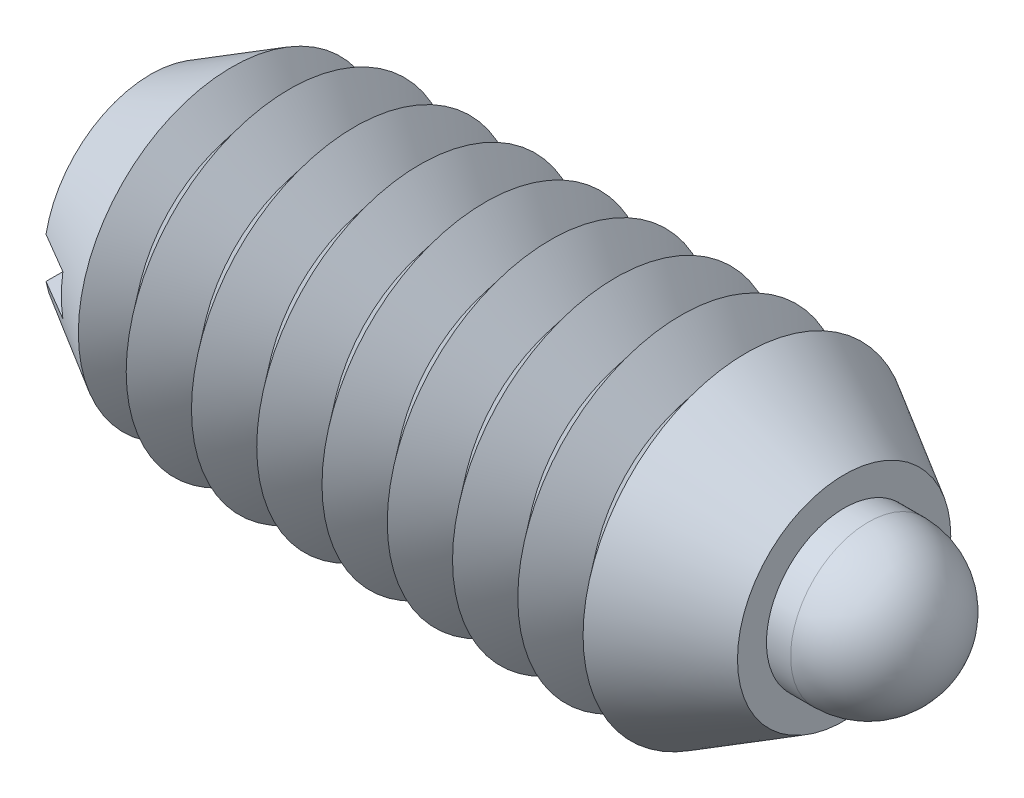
ISO-10303-21;
HEADER;
FILE_DESCRIPTION(('STEP AP214'),'2;1');
FILE_NAME('part.step','',(''),(''),'','','');
FILE_SCHEMA(('AUTOMOTIVE_DESIGN { 1 0 10303 214 1 1 1 1 }'));
ENDSEC;
DATA;
#1=APPLICATION_CONTEXT('core data for automotive mechanical design processes');
#2=APPLICATION_PROTOCOL_DEFINITION('international standard','automotive_design',2000,#1);
#3=PRODUCT_CONTEXT('',#1,'mechanical');
#4=PRODUCT('Part','Part','',(#3));
#5=PRODUCT_RELATED_PRODUCT_CATEGORY('part','',(#4));
#6=PRODUCT_DEFINITION_FORMATION('','',#4);
#7=PRODUCT_DEFINITION_CONTEXT('part definition',#1,'design');
#8=PRODUCT_DEFINITION('design','',#6,#7);
#9=PRODUCT_DEFINITION_SHAPE('','',#8);
#10=(LENGTH_UNIT() NAMED_UNIT(*) SI_UNIT(.MILLI.,.METRE.));
#11=(NAMED_UNIT(*) PLANE_ANGLE_UNIT() SI_UNIT($,.RADIAN.));
#12=(NAMED_UNIT(*) SI_UNIT($,.STERADIAN.) SOLID_ANGLE_UNIT());
#13=UNCERTAINTY_MEASURE_WITH_UNIT(LENGTH_MEASURE(1.E-05),#10,'distance_accuracy_value','');
#14=(GEOMETRIC_REPRESENTATION_CONTEXT(3) GLOBAL_UNCERTAINTY_ASSIGNED_CONTEXT((#13)) GLOBAL_UNIT_ASSIGNED_CONTEXT((#10,
#11,#12)) REPRESENTATION_CONTEXT('',''));
#15=CARTESIAN_POINT('',(0.,0.,0.));
#16=DIRECTION('',(0.,0.,1.));
#17=DIRECTION('',(1.,0.,0.));
#18=AXIS2_PLACEMENT_3D('',#15,#16,#17);
#19=CARTESIAN_POINT('',(10.01776,0.,0.));
#20=DIRECTION('',(-1.,0.,0.));
#21=DIRECTION('',(0.,-0.719424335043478,-0.694570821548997));
#22=AXIS2_PLACEMENT_3D('',#19,#20,#21);
#23=PLANE('',#22);
#24=CARTESIAN_POINT('',(10.01776,0.,0.));
#25=DIRECTION('',(1.,0.,0.));
#26=DIRECTION('',(0.,0.719424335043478,0.694570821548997));
#27=AXIS2_PLACEMENT_3D('',#24,#25,#26);
#28=CIRCLE('',#27,1.5113);
#29=CARTESIAN_POINT('',(10.01776,1.08726599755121,1.049704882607));
#30=VERTEX_POINT('',#29);
#31=EDGE_CURVE('P0_E10',#30,#30,#28,.T.);
#32=ORIENTED_EDGE('',*,*,#31,.F.);
#33=EDGE_LOOP('',(#32));
#34=FACE_BOUND('',#33,.T.);
#35=ADVANCED_FACE('P0_F14',(#34),#23,.T.);
#36=CARTESIAN_POINT('',(10.32002,0.,0.));
#37=DIRECTION('',(1.,0.,0.));
#38=DIRECTION('',(0.,0.719424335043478,0.694570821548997));
#39=AXIS2_PLACEMENT_3D('',#36,#37,#38);
#40=CONICAL_SURFACE('',#39,1.81356,0.78539816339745);
#41=ORIENTED_EDGE('',*,*,#31,.T.);
#42=EDGE_LOOP('',(#41));
#43=FACE_BOUND('',#42,.T.);
#44=CARTESIAN_POINT('',(10.32002,0.,0.));
#45=DIRECTION('',(1.,0.,0.));
#46=DIRECTION('',(0.,0.719424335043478,0.694570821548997));
#47=AXIS2_PLACEMENT_3D('',#44,#45,#46);
#48=CIRCLE('',#47,1.81356);
#49=CARTESIAN_POINT('',(10.32002,1.30471919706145,1.2596458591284));
#50=VERTEX_POINT('',#49);
#51=EDGE_CURVE('P0_E20',#50,#50,#48,.T.);
#52=ORIENTED_EDGE('',*,*,#51,.F.);
#53=EDGE_LOOP('',(#52));
#54=FACE_BOUND('',#53,.T.);
#55=ADVANCED_FACE('P0_F54',(#43,#54),#40,.T.);
#56=CARTESIAN_POINT('',(15.47495,0.,0.));
#57=DIRECTION('',(1.,0.,0.));
#58=DIRECTION('',(0.,0.719424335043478,0.694570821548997));
#59=AXIS2_PLACEMENT_3D('',#56,#57,#58);
#60=CYLINDRICAL_SURFACE('',#59,1.81356);
#61=ORIENTED_EDGE('',*,*,#51,.T.);
#62=EDGE_LOOP('',(#61));
#63=FACE_BOUND('',#62,.T.);
#64=CARTESIAN_POINT('',(12.5168303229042,0.,0.));
#65=DIRECTION('',(1.,0.,0.));
#66=DIRECTION('',(0.,0.719424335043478,0.694570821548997));
#67=AXIS2_PLACEMENT_3D('',#64,#65,#66);
#68=CIRCLE('',#67,1.81356);
#69=CARTESIAN_POINT('',(12.5168303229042,1.30471919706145,1.2596458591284));
#70=VERTEX_POINT('',#69);
#71=EDGE_CURVE('P0_E24',#70,#70,#68,.T.);
#72=ORIENTED_EDGE('',*,*,#71,.F.);
#73=EDGE_LOOP('',(#72));
#74=FACE_BOUND('',#73,.T.);
#75=ADVANCED_FACE('P0_F50',(#63,#74),#60,.T.);
#76=CARTESIAN_POINT('',(13.04036,0.,0.));
#77=DIRECTION('',(-1.,0.,0.));
#78=DIRECTION('',(0.,-0.719424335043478,-0.694570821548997));
#79=AXIS2_PLACEMENT_3D('',#76,#77,#78);
#80=CONICAL_SURFACE('',#79,1.5113,0.5235987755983);
#81=ORIENTED_EDGE('',*,*,#71,.T.);
#82=EDGE_LOOP('',(#81));
#83=FACE_BOUND('',#82,.T.);
#84=CARTESIAN_POINT('',(13.04036,0.,0.));
#85=DIRECTION('',(1.,0.,0.));
#86=DIRECTION('',(0.,0.719424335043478,0.694570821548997));
#87=AXIS2_PLACEMENT_3D('',#84,#85,#86);
#88=CIRCLE('',#87,1.5113);
#89=CARTESIAN_POINT('',(13.04036,1.08726599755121,1.049704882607));
#90=VERTEX_POINT('',#89);
#91=EDGE_CURVE('P0_E28',#90,#90,#88,.T.);
#92=ORIENTED_EDGE('',*,*,#91,.F.);
#93=EDGE_LOOP('',(#92));
#94=FACE_BOUND('',#93,.T.);
#95=ADVANCED_FACE('P0_F41',(#83,#94),#80,.T.);
#96=CARTESIAN_POINT('',(15.47495,0.,0.));
#97=DIRECTION('',(1.,0.,0.));
#98=DIRECTION('',(0.,0.719424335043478,0.694570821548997));
#99=AXIS2_PLACEMENT_3D('',#96,#97,#98);
#100=CYLINDRICAL_SURFACE('',#99,1.5113);
#101=ORIENTED_EDGE('',*,*,#91,.T.);
#102=EDGE_LOOP('',(#101));
#103=FACE_BOUND('',#102,.T.);
#104=CARTESIAN_POINT('',(13.96365,0.,0.));
#105=DIRECTION('',(1.,0.,0.));
#106=DIRECTION('',(0.,0.719424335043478,0.694570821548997));
#107=AXIS2_PLACEMENT_3D('',#104,#105,#106);
#108=CIRCLE('',#107,1.5113);
#109=CARTESIAN_POINT('',(13.96365,1.08726599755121,1.049704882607));
#110=VERTEX_POINT('',#109);
#111=EDGE_CURVE('P0_E33',#110,#110,#108,.T.);
#112=ORIENTED_EDGE('',*,*,#111,.F.);
#113=EDGE_LOOP('',(#112));
#114=FACE_BOUND('',#113,.T.);
#115=ADVANCED_FACE('P0_F39',(#103,#114),#100,.T.);
#116=CARTESIAN_POINT('',(13.96365,0.,0.));
#117=DIRECTION('',(1.,0.,0.));
#118=DIRECTION('',(0.,0.719424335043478,0.694570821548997));
#119=AXIS2_PLACEMENT_3D('',#116,#117,#118);
#120=SPHERICAL_SURFACE('',#119,1.5113);
#121=ORIENTED_EDGE('',*,*,#111,.T.);
#122=EDGE_LOOP('',(#121));
#123=FACE_BOUND('',#122,.T.);
#124=ADVANCED_FACE('P0_F37',(#123),#120,.T.);
#125=CLOSED_SHELL('',(#35,#55,#75,#95,#115,#124));
#126=MANIFOLD_SOLID_BREP('P0_B1',#125);
#127=CARTESIAN_POINT('',(13.49375,0.,0.));
#128=DIRECTION('',(1.,0.,0.));
#129=DIRECTION('',(0.,0.,-1.));
#130=AXIS2_PLACEMENT_3D('',#127,#128,#129);
#131=PLANE('',#130);
#132=CARTESIAN_POINT('',(13.49375,0.,0.));
#133=DIRECTION('',(1.,0.,0.));
#134=DIRECTION('',(0.,0.,-1.));
#135=AXIS2_PLACEMENT_3D('',#132,#133,#134);
#136=CIRCLE('',#135,2.07514773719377);
#137=CARTESIAN_POINT('',(13.49375,0.,-2.07514773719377));
#138=VERTEX_POINT('',#137);
#139=EDGE_CURVE('P1_E78',#138,#138,#136,.T.);
#140=ORIENTED_EDGE('',*,*,#139,.T.);
#141=EDGE_LOOP('',(#140));
#142=FACE_BOUND('',#141,.T.);
#143=CARTESIAN_POINT('',(13.49375,0.,0.));
#144=DIRECTION('',(-1.,0.,0.));
#145=DIRECTION('',(0.,0.,1.));
#146=AXIS2_PLACEMENT_3D('',#143,#144,#145);
#147=CIRCLE('',#146,1.5113);
#148=CARTESIAN_POINT('',(13.49375,0.,1.5113));
#149=VERTEX_POINT('',#148);
#150=EDGE_CURVE('P1_E65',#149,#149,#147,.T.);
#151=ORIENTED_EDGE('',*,*,#150,.T.);
#152=EDGE_LOOP('',(#151));
#153=FACE_BOUND('',#152,.T.);
#154=ADVANCED_FACE('P1_F15',(#142,#153),#131,.T.);
#155=CARTESIAN_POINT('',(13.49375,0.,0.));
#156=DIRECTION('',(-1.,0.,0.));
#157=DIRECTION('',(0.,0.,1.));
#158=AXIS2_PLACEMENT_3D('',#155,#156,#157);
#159=CONICAL_SURFACE('',#158,2.07514773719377,0.523598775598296);
#160=CARTESIAN_POINT('',(11.58875,0.,0.));
#161=DIRECTION('',(-1.,0.,0.));
#162=DIRECTION('',(0.,0.,1.));
#163=AXIS2_PLACEMENT_3D('',#160,#161,#162);
#164=CIRCLE('',#163,3.175);
#165=CARTESIAN_POINT('',(11.58875,0.,3.175));
#166=VERTEX_POINT('',#165);
#167=EDGE_CURVE('P1_E127',#166,#166,#164,.T.);
#168=ORIENTED_EDGE('',*,*,#167,.F.);
#169=EDGE_LOOP('',(#168));
#170=FACE_BOUND('',#169,.T.);
#171=ORIENTED_EDGE('',*,*,#139,.F.);
#172=EDGE_LOOP('',(#171));
#173=FACE_BOUND('',#172,.T.);
#174=ADVANCED_FACE('P1_F17',(#170,#173),#159,.T.);
#175=CARTESIAN_POINT('',(0.,0.,0.));
#176=DIRECTION('',(-1.,0.,0.));
#177=DIRECTION('',(0.,0.,1.));
#178=AXIS2_PLACEMENT_3D('',#175,#176,#177);
#179=CYLINDRICAL_SURFACE('',#178,1.5113);
#180=CARTESIAN_POINT('',(13.04036,0.,0.));
#181=DIRECTION('',(-1.,0.,0.));
#182=DIRECTION('',(0.,0.,1.));
#183=AXIS2_PLACEMENT_3D('',#180,#181,#182);
#184=CIRCLE('',#183,1.5113);
#185=CARTESIAN_POINT('',(13.04036,0.,1.5113));
#186=VERTEX_POINT('',#185);
#187=EDGE_CURVE('P1_E115',#186,#186,#184,.T.);
#188=ORIENTED_EDGE('',*,*,#187,.T.);
#189=EDGE_LOOP('',(#188));
#190=FACE_BOUND('',#189,.T.);
#191=ORIENTED_EDGE('',*,*,#150,.F.);
#192=EDGE_LOOP('',(#191));
#193=FACE_BOUND('',#192,.T.);
#194=ADVANCED_FACE('P1_F196',(#190,#193),#179,.F.);
#195=CARTESIAN_POINT('',(13.04036,0.,0.));
#196=DIRECTION('',(-1.,0.,0.));
#197=DIRECTION('',(0.,0.,1.));
#198=AXIS2_PLACEMENT_3D('',#195,#196,#197);
#199=CONICAL_SURFACE('',#198,1.5113,0.785398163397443);
#200=CARTESIAN_POINT('',(12.7381,0.,0.));
#201=DIRECTION('',(-1.,0.,0.));
#202=DIRECTION('',(0.,0.,1.));
#203=AXIS2_PLACEMENT_3D('',#200,#201,#202);
#204=CIRCLE('',#203,1.81356);
#205=CARTESIAN_POINT('',(12.7381,0.,1.81356));
#206=VERTEX_POINT('',#205);
#207=EDGE_CURVE('P1_E118',#206,#206,#204,.T.);
#208=ORIENTED_EDGE('',*,*,#207,.T.);
#209=EDGE_LOOP('',(#208));
#210=FACE_BOUND('',#209,.T.);
#211=ORIENTED_EDGE('',*,*,#187,.F.);
#212=EDGE_LOOP('',(#211));
#213=FACE_BOUND('',#212,.T.);
#214=ADVANCED_FACE('P1_F203',(#210,#213),#199,.F.);
#215=CARTESIAN_POINT('',(0.,0.,0.));
#216=DIRECTION('',(-1.,0.,0.));
#217=DIRECTION('',(0.,0.,1.));
#218=AXIS2_PLACEMENT_3D('',#215,#216,#217);
#219=CYLINDRICAL_SURFACE('',#218,1.81356);
#220=CARTESIAN_POINT('',(2.38125,0.,0.));
#221=DIRECTION('',(-1.,0.,0.));
#222=DIRECTION('',(0.,0.,1.));
#223=AXIS2_PLACEMENT_3D('',#220,#221,#222);
#224=CIRCLE('',#223,1.81356);
#225=CARTESIAN_POINT('',(2.38125,0.,1.81356));
#226=VERTEX_POINT('',#225);
#227=EDGE_CURVE('P1_E121',#226,#226,#224,.T.);
#228=ORIENTED_EDGE('',*,*,#227,.T.);
#229=EDGE_LOOP('',(#228));
#230=FACE_BOUND('',#229,.T.);
#231=ORIENTED_EDGE('',*,*,#207,.F.);
#232=EDGE_LOOP('',(#231));
#233=FACE_BOUND('',#232,.T.);
#234=ADVANCED_FACE('P1_F208',(#230,#233),#219,.F.);
#235=CARTESIAN_POINT('',(2.38125,0.,0.));
#236=DIRECTION('',(1.,0.,0.));
#237=DIRECTION('',(0.,0.,-1.));
#238=AXIS2_PLACEMENT_3D('',#235,#236,#237);
#239=PLANE('',#238);
#240=ORIENTED_EDGE('',*,*,#227,.F.);
#241=EDGE_LOOP('',(#240));
#242=FACE_BOUND('',#241,.T.);
#243=ADVANCED_FACE('P1_F214',(#242),#239,.T.);
#244=CARTESIAN_POINT('',(10.95375,0.,0.));
#245=DIRECTION('',(1.,0.,0.));
#246=DIRECTION('',(0.,0.,-1.));
#247=AXIS2_PLACEMENT_3D('',#244,#245,#246);
#248=CONICAL_SURFACE('',#247,2.3818852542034,0.895664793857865);
#249=ORIENTED_EDGE('',*,*,#167,.T.);
#250=EDGE_LOOP('',(#249));
#251=FACE_BOUND('',#250,.T.);
#252=CARTESIAN_POINT('',(10.95375,0.,0.));
#253=DIRECTION('',(-1.,0.,0.));
#254=DIRECTION('',(0.,0.,1.));
#255=AXIS2_PLACEMENT_3D('',#252,#253,#254);
#256=CIRCLE('',#255,2.3818852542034);
#257=CARTESIAN_POINT('',(10.95375,0.,2.3818852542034));
#258=VERTEX_POINT('',#257);
#259=EDGE_CURVE('P1_E124',#258,#258,#256,.T.);
#260=ORIENTED_EDGE('',*,*,#259,.F.);
#261=EDGE_LOOP('',(#260));
#262=FACE_BOUND('',#261,.T.);
#263=ADVANCED_FACE('P1_F218',(#251,#262),#248,.T.);
#264=CARTESIAN_POINT('',(10.31875,0.,0.));
#265=DIRECTION('',(-1.,0.,0.));
#266=DIRECTION('',(0.,0.,1.));
#267=AXIS2_PLACEMENT_3D('',#264,#265,#266);
#268=CONICAL_SURFACE('',#267,3.175,0.895664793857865);
#269=ORIENTED_EDGE('',*,*,#259,.T.);
#270=EDGE_LOOP('',(#269));
#271=FACE_BOUND('',#270,.T.);
#272=CARTESIAN_POINT('',(10.31875,0.,0.));
#273=DIRECTION('',(-1.,0.,0.));
#274=DIRECTION('',(0.,0.,1.));
#275=AXIS2_PLACEMENT_3D('',#272,#273,#274);
#276=CIRCLE('',#275,3.175);
#277=CARTESIAN_POINT('',(10.31875,0.,3.175));
#278=VERTEX_POINT('',#277);
#279=EDGE_CURVE('P1_E133',#278,#278,#276,.T.);
#280=ORIENTED_EDGE('',*,*,#279,.F.);
#281=EDGE_LOOP('',(#280));
#282=FACE_BOUND('',#281,.T.);
#283=ADVANCED_FACE('P1_F222',(#271,#282),#268,.T.);
#284=CARTESIAN_POINT('',(9.68374999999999,0.,0.));
#285=DIRECTION('',(1.,0.,0.));
#286=DIRECTION('',(0.,0.,-1.));
#287=AXIS2_PLACEMENT_3D('',#284,#285,#286);
#288=CONICAL_SURFACE('',#287,2.3818852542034,0.895664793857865);
#289=ORIENTED_EDGE('',*,*,#279,.T.);
#290=EDGE_LOOP('',(#289));
#291=FACE_BOUND('',#290,.T.);
#292=CARTESIAN_POINT('',(9.68374999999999,0.,0.));
#293=DIRECTION('',(-1.,0.,0.));
#294=DIRECTION('',(0.,0.,1.));
#295=AXIS2_PLACEMENT_3D('',#292,#293,#294);
#296=CIRCLE('',#295,2.3818852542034);
#297=CARTESIAN_POINT('',(9.68374999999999,0.,2.3818852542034));
#298=VERTEX_POINT('',#297);
#299=EDGE_CURVE('P1_E130',#298,#298,#296,.T.);
#300=ORIENTED_EDGE('',*,*,#299,.F.);
#301=EDGE_LOOP('',(#300));
#302=FACE_BOUND('',#301,.T.);
#303=ADVANCED_FACE('P1_F226',(#291,#302),#288,.T.);
#304=CARTESIAN_POINT('',(9.04874999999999,0.,0.));
#305=DIRECTION('',(-1.,0.,0.));
#306=DIRECTION('',(0.,0.,1.));
#307=AXIS2_PLACEMENT_3D('',#304,#305,#306);
#308=CONICAL_SURFACE('',#307,3.175,0.895664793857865);
#309=ORIENTED_EDGE('',*,*,#299,.T.);
#310=EDGE_LOOP('',(#309));
#311=FACE_BOUND('',#310,.T.);
#312=CARTESIAN_POINT('',(9.04874999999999,0.,0.));
#313=DIRECTION('',(-1.,0.,0.));
#314=DIRECTION('',(0.,0.,1.));
#315=AXIS2_PLACEMENT_3D('',#312,#313,#314);
#316=CIRCLE('',#315,3.175);
#317=CARTESIAN_POINT('',(9.04874999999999,0.,3.175));
#318=VERTEX_POINT('',#317);
#319=EDGE_CURVE('P1_E139',#318,#318,#316,.T.);
#320=ORIENTED_EDGE('',*,*,#319,.F.);
#321=EDGE_LOOP('',(#320));
#322=FACE_BOUND('',#321,.T.);
#323=ADVANCED_FACE('P1_F230',(#311,#322),#308,.T.);
#324=CARTESIAN_POINT('',(8.41374999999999,0.,0.));
#325=DIRECTION('',(1.,0.,0.));
#326=DIRECTION('',(0.,0.,-1.));
#327=AXIS2_PLACEMENT_3D('',#324,#325,#326);
#328=CONICAL_SURFACE('',#327,2.3818852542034,0.895664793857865);
#329=ORIENTED_EDGE('',*,*,#319,.T.);
#330=EDGE_LOOP('',(#329));
#331=FACE_BOUND('',#330,.T.);
#332=CARTESIAN_POINT('',(8.41374999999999,0.,0.));
#333=DIRECTION('',(-1.,0.,0.));
#334=DIRECTION('',(0.,0.,1.));
#335=AXIS2_PLACEMENT_3D('',#332,#333,#334);
#336=CIRCLE('',#335,2.3818852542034);
#337=CARTESIAN_POINT('',(8.41374999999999,0.,2.3818852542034));
#338=VERTEX_POINT('',#337);
#339=EDGE_CURVE('P1_E136',#338,#338,#336,.T.);
#340=ORIENTED_EDGE('',*,*,#339,.F.);
#341=EDGE_LOOP('',(#340));
#342=FACE_BOUND('',#341,.T.);
#343=ADVANCED_FACE('P1_F234',(#331,#342),#328,.T.);
#344=CARTESIAN_POINT('',(7.77874999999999,0.,0.));
#345=DIRECTION('',(-1.,0.,0.));
#346=DIRECTION('',(0.,0.,1.));
#347=AXIS2_PLACEMENT_3D('',#344,#345,#346);
#348=CONICAL_SURFACE('',#347,3.175,0.895664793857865);
#349=ORIENTED_EDGE('',*,*,#339,.T.);
#350=EDGE_LOOP('',(#349));
#351=FACE_BOUND('',#350,.T.);
#352=CARTESIAN_POINT('',(7.77874999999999,0.,0.));
#353=DIRECTION('',(-1.,0.,0.));
#354=DIRECTION('',(0.,0.,1.));
#355=AXIS2_PLACEMENT_3D('',#352,#353,#354);
#356=CIRCLE('',#355,3.175);
#357=CARTESIAN_POINT('',(7.77874999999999,0.,3.175));
#358=VERTEX_POINT('',#357);
#359=EDGE_CURVE('P1_E145',#358,#358,#356,.T.);
#360=ORIENTED_EDGE('',*,*,#359,.F.);
#361=EDGE_LOOP('',(#360));
#362=FACE_BOUND('',#361,.T.);
#363=ADVANCED_FACE('P1_F238',(#351,#362),#348,.T.);
#364=CARTESIAN_POINT('',(7.14374999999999,0.,0.));
#365=DIRECTION('',(1.,0.,0.));
#366=DIRECTION('',(0.,0.,-1.));
#367=AXIS2_PLACEMENT_3D('',#364,#365,#366);
#368=CONICAL_SURFACE('',#367,2.3818852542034,0.895664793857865);
#369=ORIENTED_EDGE('',*,*,#359,.T.);
#370=EDGE_LOOP('',(#369));
#371=FACE_BOUND('',#370,.T.);
#372=CARTESIAN_POINT('',(7.14374999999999,0.,0.));
#373=DIRECTION('',(-1.,0.,0.));
#374=DIRECTION('',(0.,0.,1.));
#375=AXIS2_PLACEMENT_3D('',#372,#373,#374);
#376=CIRCLE('',#375,2.3818852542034);
#377=CARTESIAN_POINT('',(7.14374999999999,0.,2.3818852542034));
#378=VERTEX_POINT('',#377);
#379=EDGE_CURVE('P1_E142',#378,#378,#376,.T.);
#380=ORIENTED_EDGE('',*,*,#379,.F.);
#381=EDGE_LOOP('',(#380));
#382=FACE_BOUND('',#381,.T.);
#383=ADVANCED_FACE('P1_F242',(#371,#382),#368,.T.);
#384=CARTESIAN_POINT('',(6.50874999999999,0.,0.));
#385=DIRECTION('',(-1.,0.,0.));
#386=DIRECTION('',(0.,0.,1.));
#387=AXIS2_PLACEMENT_3D('',#384,#385,#386);
#388=CONICAL_SURFACE('',#387,3.175,0.895664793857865);
#389=ORIENTED_EDGE('',*,*,#379,.T.);
#390=EDGE_LOOP('',(#389));
#391=FACE_BOUND('',#390,.T.);
#392=CARTESIAN_POINT('',(6.50874999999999,0.,0.));
#393=DIRECTION('',(-1.,0.,0.));
#394=DIRECTION('',(0.,0.,1.));
#395=AXIS2_PLACEMENT_3D('',#392,#393,#394);
#396=CIRCLE('',#395,3.175);
#397=CARTESIAN_POINT('',(6.50874999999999,0.,3.175));
#398=VERTEX_POINT('',#397);
#399=EDGE_CURVE('P1_E151',#398,#398,#396,.T.);
#400=ORIENTED_EDGE('',*,*,#399,.F.);
#401=EDGE_LOOP('',(#400));
#402=FACE_BOUND('',#401,.T.);
#403=ADVANCED_FACE('P1_F246',(#391,#402),#388,.T.);
#404=CARTESIAN_POINT('',(5.87374999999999,0.,0.));
#405=DIRECTION('',(1.,0.,0.));
#406=DIRECTION('',(0.,0.,-1.));
#407=AXIS2_PLACEMENT_3D('',#404,#405,#406);
#408=CONICAL_SURFACE('',#407,2.3818852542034,0.895664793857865);
#409=ORIENTED_EDGE('',*,*,#399,.T.);
#410=EDGE_LOOP('',(#409));
#411=FACE_BOUND('',#410,.T.);
#412=CARTESIAN_POINT('',(5.87374999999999,0.,0.));
#413=DIRECTION('',(-1.,0.,0.));
#414=DIRECTION('',(0.,0.,1.));
#415=AXIS2_PLACEMENT_3D('',#412,#413,#414);
#416=CIRCLE('',#415,2.3818852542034);
#417=CARTESIAN_POINT('',(5.87374999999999,0.,2.3818852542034));
#418=VERTEX_POINT('',#417);
#419=EDGE_CURVE('P1_E148',#418,#418,#416,.T.);
#420=ORIENTED_EDGE('',*,*,#419,.F.);
#421=EDGE_LOOP('',(#420));
#422=FACE_BOUND('',#421,.T.);
#423=ADVANCED_FACE('P1_F250',(#411,#422),#408,.T.);
#424=CARTESIAN_POINT('',(5.23874999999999,0.,0.));
#425=DIRECTION('',(-1.,0.,0.));
#426=DIRECTION('',(0.,0.,1.));
#427=AXIS2_PLACEMENT_3D('',#424,#425,#426);
#428=CONICAL_SURFACE('',#427,3.175,0.895664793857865);
#429=ORIENTED_EDGE('',*,*,#419,.T.);
#430=EDGE_LOOP('',(#429));
#431=FACE_BOUND('',#430,.T.);
#432=CARTESIAN_POINT('',(5.23874999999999,0.,0.));
#433=DIRECTION('',(-1.,0.,0.));
#434=DIRECTION('',(0.,0.,1.));
#435=AXIS2_PLACEMENT_3D('',#432,#433,#434);
#436=CIRCLE('',#435,3.175);
#437=CARTESIAN_POINT('',(5.23874999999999,0.,3.175));
#438=VERTEX_POINT('',#437);
#439=EDGE_CURVE('P1_E157',#438,#438,#436,.T.);
#440=ORIENTED_EDGE('',*,*,#439,.F.);
#441=EDGE_LOOP('',(#440));
#442=FACE_BOUND('',#441,.T.);
#443=ADVANCED_FACE('P1_F254',(#431,#442),#428,.T.);
#444=CARTESIAN_POINT('',(4.60374999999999,0.,0.));
#445=DIRECTION('',(1.,0.,0.));
#446=DIRECTION('',(0.,0.,-1.));
#447=AXIS2_PLACEMENT_3D('',#444,#445,#446);
#448=CONICAL_SURFACE('',#447,2.3818852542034,0.895664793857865);
#449=ORIENTED_EDGE('',*,*,#439,.T.);
#450=EDGE_LOOP('',(#449));
#451=FACE_BOUND('',#450,.T.);
#452=CARTESIAN_POINT('',(4.60374999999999,0.,0.));
#453=DIRECTION('',(-1.,0.,0.));
#454=DIRECTION('',(0.,0.,1.));
#455=AXIS2_PLACEMENT_3D('',#452,#453,#454);
#456=CIRCLE('',#455,2.3818852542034);
#457=CARTESIAN_POINT('',(4.60374999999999,0.,2.3818852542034));
#458=VERTEX_POINT('',#457);
#459=EDGE_CURVE('P1_E154',#458,#458,#456,.T.);
#460=ORIENTED_EDGE('',*,*,#459,.F.);
#461=EDGE_LOOP('',(#460));
#462=FACE_BOUND('',#461,.T.);
#463=ADVANCED_FACE('P1_F258',(#451,#462),#448,.T.);
#464=CARTESIAN_POINT('',(3.96874999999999,0.,0.));
#465=DIRECTION('',(-1.,0.,0.));
#466=DIRECTION('',(0.,0.,1.));
#467=AXIS2_PLACEMENT_3D('',#464,#465,#466);
#468=CONICAL_SURFACE('',#467,3.175,0.895664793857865);
#469=ORIENTED_EDGE('',*,*,#459,.T.);
#470=EDGE_LOOP('',(#469));
#471=FACE_BOUND('',#470,.T.);
#472=CARTESIAN_POINT('',(3.96874999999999,0.,0.));
#473=DIRECTION('',(-1.,0.,0.));
#474=DIRECTION('',(0.,0.,1.));
#475=AXIS2_PLACEMENT_3D('',#472,#473,#474);
#476=CIRCLE('',#475,3.175);
#477=CARTESIAN_POINT('',(3.96874999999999,0.,3.175));
#478=VERTEX_POINT('',#477);
#479=EDGE_CURVE('P1_E163',#478,#478,#476,.T.);
#480=ORIENTED_EDGE('',*,*,#479,.F.);
#481=EDGE_LOOP('',(#480));
#482=FACE_BOUND('',#481,.T.);
#483=ADVANCED_FACE('P1_F188',(#471,#482),#468,.T.);
#484=CARTESIAN_POINT('',(3.33374999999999,0.,0.));
#485=DIRECTION('',(1.,0.,0.));
#486=DIRECTION('',(0.,0.,-1.));
#487=AXIS2_PLACEMENT_3D('',#484,#485,#486);
#488=CONICAL_SURFACE('',#487,2.3818852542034,0.895664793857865);
#489=ORIENTED_EDGE('',*,*,#479,.T.);
#490=EDGE_LOOP('',(#489));
#491=FACE_BOUND('',#490,.T.);
#492=CARTESIAN_POINT('',(3.33374999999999,0.,0.));
#493=DIRECTION('',(-1.,0.,0.));
#494=DIRECTION('',(0.,0.,1.));
#495=AXIS2_PLACEMENT_3D('',#492,#493,#494);
#496=CIRCLE('',#495,2.3818852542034);
#497=CARTESIAN_POINT('',(3.33374999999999,0.,2.3818852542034));
#498=VERTEX_POINT('',#497);
#499=EDGE_CURVE('P1_E160',#498,#498,#496,.T.);
#500=ORIENTED_EDGE('',*,*,#499,.F.);
#501=EDGE_LOOP('',(#500));
#502=FACE_BOUND('',#501,.T.);
#503=ADVANCED_FACE('P1_F178',(#491,#502),#488,.T.);
#504=CARTESIAN_POINT('',(2.69874999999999,0.,0.));
#505=DIRECTION('',(-1.,0.,0.));
#506=DIRECTION('',(0.,0.,1.));
#507=AXIS2_PLACEMENT_3D('',#504,#505,#506);
#508=CONICAL_SURFACE('',#507,3.175,0.895664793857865);
#509=ORIENTED_EDGE('',*,*,#499,.T.);
#510=EDGE_LOOP('',(#509));
#511=FACE_BOUND('',#510,.T.);
#512=CARTESIAN_POINT('',(2.69874999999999,0.,0.));
#513=DIRECTION('',(-1.,0.,0.));
#514=DIRECTION('',(0.,0.,1.));
#515=AXIS2_PLACEMENT_3D('',#512,#513,#514);
#516=CIRCLE('',#515,3.175);
#517=CARTESIAN_POINT('',(2.69874999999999,0.,3.175));
#518=VERTEX_POINT('',#517);
#519=EDGE_CURVE('P1_E169',#518,#518,#516,.T.);
#520=ORIENTED_EDGE('',*,*,#519,.F.);
#521=EDGE_LOOP('',(#520));
#522=FACE_BOUND('',#521,.T.);
#523=ADVANCED_FACE('P1_F176',(#511,#522),#508,.T.);
#524=CARTESIAN_POINT('',(2.06374999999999,0.,0.));
#525=DIRECTION('',(1.,0.,0.));
#526=DIRECTION('',(0.,0.,-1.));
#527=AXIS2_PLACEMENT_3D('',#524,#525,#526);
#528=CONICAL_SURFACE('',#527,2.3818852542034,0.895664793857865);
#529=ORIENTED_EDGE('',*,*,#519,.T.);
#530=EDGE_LOOP('',(#529));
#531=FACE_BOUND('',#530,.T.);
#532=CARTESIAN_POINT('',(2.06374999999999,0.,0.));
#533=DIRECTION('',(-1.,0.,0.));
#534=DIRECTION('',(0.,0.,1.));
#535=AXIS2_PLACEMENT_3D('',#532,#533,#534);
#536=CIRCLE('',#535,2.3818852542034);
#537=CARTESIAN_POINT('',(2.06374999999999,0.,2.3818852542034));
#538=VERTEX_POINT('',#537);
#539=EDGE_CURVE('P1_E166',#538,#538,#536,.T.);
#540=ORIENTED_EDGE('',*,*,#539,.F.);
#541=EDGE_LOOP('',(#540));
#542=FACE_BOUND('',#541,.T.);
#543=ADVANCED_FACE('P1_F173',(#531,#542),#528,.T.);
#544=CARTESIAN_POINT('',(1.42874999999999,0.,0.));
#545=DIRECTION('',(-1.,0.,0.));
#546=DIRECTION('',(0.,0.,1.));
#547=AXIS2_PLACEMENT_3D('',#544,#545,#546);
#548=CONICAL_SURFACE('',#547,3.175,0.895664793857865);
#549=CARTESIAN_POINT('',(1.57930333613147,0.,0.));
#550=DIRECTION('',(-1.,0.,0.));
#551=DIRECTION('',(0.,0.,1.));
#552=AXIS2_PLACEMENT_3D('',#549,#550,#551);
#553=CIRCLE('',#552,2.98695894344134);
#554=CARTESIAN_POINT('',(1.57930333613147,0.,2.98695894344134));
#555=VERTEX_POINT('',#554);
#556=EDGE_CURVE('P1_E19',#555,#555,#553,.T.);
#557=ORIENTED_EDGE('',*,*,#556,.F.);
#558=EDGE_LOOP('',(#557));
#559=FACE_BOUND('',#558,.T.);
#560=ORIENTED_EDGE('',*,*,#539,.T.);
#561=EDGE_LOOP('',(#560));
#562=FACE_BOUND('',#561,.T.);
#563=ADVANCED_FACE('P1_F186',(#559,#562),#548,.T.);
#564=CARTESIAN_POINT('',(0.,0.,0.));
#565=DIRECTION('',(1.,0.,0.));
#566=DIRECTION('',(0.,0.,-1.));
#567=AXIS2_PLACEMENT_3D('',#564,#565,#566);
#568=PLANE('',#567);
#569=CARTESIAN_POINT('',(0.,0.,0.));
#570=DIRECTION('',(1.,0.,0.));
#571=DIRECTION('',(0.,0.,-1.));
#572=AXIS2_PLACEMENT_3D('',#569,#570,#571);
#573=CIRCLE('',#572,2.07514773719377);
#574=CARTESIAN_POINT('',(0.,-0.396875,-2.03684274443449));
#575=VERTEX_POINT('',#574);
#576=CARTESIAN_POINT('',(0.,-0.396875,2.03684274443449));
#577=VERTEX_POINT('',#576);
#578=EDGE_CURVE('P1_E74',#575,#577,#573,.F.);
#579=ORIENTED_EDGE('',*,*,#578,.T.);
#580=DIRECTION('',(0.,0.,1.));
#581=VECTOR('',#580,1.);
#582=CARTESIAN_POINT('',(0.,-0.396875,-3.175));
#583=LINE('',#582,#581);
#584=EDGE_CURVE('P1_E32',#575,#577,#583,.T.);
#585=ORIENTED_EDGE('',*,*,#584,.F.);
#586=EDGE_LOOP('',(#579,#585));
#587=FACE_BOUND('',#586,.T.);
#588=ADVANCED_FACE('P1_F100',(#587),#568,.F.);
#589=CARTESIAN_POINT('',(0.,-0.396875,-3.175));
#590=DIRECTION('',(0.,-1.,0.));
#591=DIRECTION('',(0.,0.,-1.));
#592=AXIS2_PLACEMENT_3D('',#589,#590,#591);
#593=PLANE('',#592);
#594=CARTESIAN_POINT('',(4.63360025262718,-0.396875,-4.73375033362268));
#595=CARTESIAN_POINT('',(4.40225577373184,-0.396875,-4.59971325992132));
#596=CARTESIAN_POINT('',(4.1709270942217,-0.396875,-4.46564886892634));
#597=CARTESIAN_POINT('',(3.70831487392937,-0.396875,-4.19744166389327));
#598=CARTESIAN_POINT('',(3.47703133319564,-0.396875,-4.06329884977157));
#599=CARTESIAN_POINT('',(2.78317868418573,-0.396875,-3.66066483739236));
#600=CARTESIAN_POINT('',(2.32069838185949,-0.396875,-3.39202067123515));
#601=CARTESIAN_POINT('',(1.40822725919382,-0.396875,-2.86099325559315));
#602=CARTESIAN_POINT('',(0.958225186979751,-0.396875,-2.59862938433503));
#603=CARTESIAN_POINT('',(0.284033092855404,-0.396875,-2.20378597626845));
#604=CARTESIAN_POINT('',(0.0594566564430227,-0.396875,-2.07196652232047));
#605=CARTESIAN_POINT('',(-0.389242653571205,-0.396875,-1.80755883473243));
#606=CARTESIAN_POINT('',(-0.613365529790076,-0.396875,-1.67497060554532));
#607=CARTESIAN_POINT('',(-0.949483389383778,-0.396875,-1.47457737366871));
#608=CARTESIAN_POINT('',(-1.06181776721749,-0.396875,-1.40734242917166));
#609=CARTESIAN_POINT('',(-1.28616598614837,-0.396875,-1.27225327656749));
#610=CARTESIAN_POINT('',(-1.39817970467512,-0.396875,-1.20439886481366));
#611=CARTESIAN_POINT('',(-1.62279263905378,-0.396875,-1.06704407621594));
#612=CARTESIAN_POINT('',(-1.73538591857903,-0.396875,-0.997533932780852));
#613=CARTESIAN_POINT('',(-1.90340740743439,-0.396875,-0.892004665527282));
#614=CARTESIAN_POINT('',(-1.9592429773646,-0.396875,-0.856635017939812));
#615=CARTESIAN_POINT('',(-2.07051796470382,-0.396875,-0.785280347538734));
#616=CARTESIAN_POINT('',(-2.12595739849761,-0.396875,-0.749295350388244));
#617=CARTESIAN_POINT('',(-2.2362867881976,-0.396875,-0.676389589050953));
#618=CARTESIAN_POINT('',(-2.29117623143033,-0.396875,-0.639468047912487));
#619=CARTESIAN_POINT('',(-2.4001507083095,-0.396875,-0.564119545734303));
#620=CARTESIAN_POINT('',(-2.45423312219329,-0.396875,-0.525688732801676));
#621=CARTESIAN_POINT('',(-2.53374291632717,-0.396875,-0.466412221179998));
#622=CARTESIAN_POINT('',(-2.55985195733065,-0.396875,-0.446484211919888));
#623=CARTESIAN_POINT('',(-2.61141791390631,-0.396875,-0.405805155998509));
#624=CARTESIAN_POINT('',(-2.63687497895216,-0.396875,-0.385054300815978));
#625=CARTESIAN_POINT('',(-2.68669748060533,-0.396875,-0.342480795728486));
#626=CARTESIAN_POINT('',(-2.71106704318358,-0.396875,-0.3206629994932));
#627=CARTESIAN_POINT('',(-2.75819349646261,-0.396875,-0.27536409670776));
#628=CARTESIAN_POINT('',(-2.78095296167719,-0.396875,-0.251885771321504));
#629=CARTESIAN_POINT('',(-2.8098915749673,-0.396875,-0.218235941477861));
#630=CARTESIAN_POINT('',(-2.81735218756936,-0.396875,-0.209175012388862));
#631=CARTESIAN_POINT('',(-2.83177709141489,-0.396875,-0.190664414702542));
#632=CARTESIAN_POINT('',(-2.83874115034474,-0.396875,-0.181214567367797));
#633=CARTESIAN_POINT('',(-2.85864241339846,-0.396875,-0.152259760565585));
#634=CARTESIAN_POINT('',(-2.87065924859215,-0.396875,-0.132071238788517));
#635=CARTESIAN_POINT('',(-2.88661762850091,-0.396875,-0.0978105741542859));
#636=CARTESIAN_POINT('',(-2.89188802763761,-0.396875,-0.0843674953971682));
#637=CARTESIAN_POINT('',(-2.90024255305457,-0.396875,-0.0568103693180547));
#638=CARTESIAN_POINT('',(-2.90332959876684,-0.396875,-0.0426972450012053));
#639=CARTESIAN_POINT('',(-2.90687418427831,-0.396875,-0.0140056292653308));
#640=CARTESIAN_POINT('',(-2.90730892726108,-0.396875,0.00057581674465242));
#641=CARTESIAN_POINT('',(-2.90540833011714,-0.396875,0.0295529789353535));
#642=CARTESIAN_POINT('',(-2.90307176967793,-0.396875,0.0439486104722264));
#643=CARTESIAN_POINT('',(-2.89527474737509,-0.396875,0.0750736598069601));
#644=CARTESIAN_POINT('',(-2.88926238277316,-0.396875,0.0916601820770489));
#645=CARTESIAN_POINT('',(-2.87473923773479,-0.396875,0.12370226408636));
#646=CARTESIAN_POINT('',(-2.86622089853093,-0.396875,0.139154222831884));
#647=CARTESIAN_POINT('',(-2.84475357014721,-0.396875,0.173406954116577));
#648=CARTESIAN_POINT('',(-2.83123942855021,-0.396875,0.191845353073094));
#649=CARTESIAN_POINT('',(-2.80250837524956,-0.396875,0.227363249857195));
#650=CARTESIAN_POINT('',(-2.78728772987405,-0.396875,0.244439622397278));
#651=CARTESIAN_POINT('',(-2.75566122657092,-0.396875,0.277670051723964));
#652=CARTESIAN_POINT('',(-2.73924790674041,-0.396875,0.293816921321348));
#653=CARTESIAN_POINT('',(-2.7057045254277,-0.396875,0.325300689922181));
#654=CARTESIAN_POINT('',(-2.68857527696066,-0.396875,0.340638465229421));
#655=CARTESIAN_POINT('',(-2.63260406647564,-0.396875,0.389073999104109));
#656=CARTESIAN_POINT('',(-2.59276503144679,-0.396875,0.421012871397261));
#657=CARTESIAN_POINT('',(-2.51178428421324,-0.396875,0.483204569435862));
#658=CARTESIAN_POINT('',(-2.47064172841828,-0.396875,0.513456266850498));
#659=CARTESIAN_POINT('',(-2.38748526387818,-0.396875,0.572917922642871));
#660=CARTESIAN_POINT('',(-2.34546974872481,-0.396875,0.602125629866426));
#661=CARTESIAN_POINT('',(-2.26093919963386,-0.396875,0.659776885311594));
#662=CARTESIAN_POINT('',(-2.21842431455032,-0.396875,0.688220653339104));
#663=CARTESIAN_POINT('',(-2.09053542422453,-0.396875,0.772641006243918));
#664=CARTESIAN_POINT('',(-2.0046417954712,-0.396875,0.827828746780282));
#665=CARTESIAN_POINT('',(-1.83222051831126,-0.396875,0.936966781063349));
#666=CARTESIAN_POINT('',(-1.74569373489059,-0.396875,0.990918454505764));
#667=CARTESIAN_POINT('',(-1.5726941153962,-0.396875,1.09776741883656));
#668=CARTESIAN_POINT('',(-1.48622395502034,-0.396875,1.15066904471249));
#669=CARTESIAN_POINT('',(-1.31298674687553,-0.396875,1.2559843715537));
#670=CARTESIAN_POINT('',(-1.22621969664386,-0.396875,1.30839806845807));
#671=CARTESIAN_POINT('',(-0.965609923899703,-0.396875,1.46513773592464));
#672=CARTESIAN_POINT('',(-0.791463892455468,-0.396875,1.56895903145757));
#673=CARTESIAN_POINT('',(-0.442653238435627,-0.396875,1.77592898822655));
#674=CARTESIAN_POINT('',(-0.26798839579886,-0.396875,1.8790772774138));
#675=CARTESIAN_POINT('',(0.0816044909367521,-0.396875,2.08492026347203));
#676=CARTESIAN_POINT('',(0.256532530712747,-0.396875,2.18761496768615));
#677=CARTESIAN_POINT('',(0.781352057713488,-0.396875,2.49514176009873));
#678=CARTESIAN_POINT('',(1.13149514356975,-0.396875,2.69954416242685));
#679=CARTESIAN_POINT('',(1.83205333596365,-0.396875,3.1077624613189));
#680=CARTESIAN_POINT('',(2.18246839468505,-0.396875,3.31157844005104));
#681=CARTESIAN_POINT('',(2.70793364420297,-0.396875,3.61688242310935));
#682=CARTESIAN_POINT('',(2.88291239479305,-0.396875,3.71849339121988));
#683=CARTESIAN_POINT('',(3.23291385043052,-0.396875,3.9216545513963));
#684=CARTESIAN_POINT('',(3.4079365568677,-0.396875,4.0232047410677));
#685=CARTESIAN_POINT('',(3.75805566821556,-0.396875,4.22627967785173));
#686=CARTESIAN_POINT('',(3.93315208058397,-0.396875,4.32780441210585));
#687=CARTESIAN_POINT('',(4.28336260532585,-0.396875,4.53080829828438));
#688=CARTESIAN_POINT('',(4.45847671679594,-0.396875,4.63228745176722));
#689=CARTESIAN_POINT('',(4.63360025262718,-0.396875,4.73375033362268));
#690=B_SPLINE_CURVE_WITH_KNOTS('',3,(#594,#595,#596,#597,#598,#599,#600,#601,#602,#603,#604,
#605,#606,#607,#608,#609,#610,#611,#612,#613,#614,#615,#616,#617,#618,#619,#620,#621,#622,#623,
#624,#625,#626,#627,#628,#629,#630,#631,#632,#633,#634,#635,#636,#637,#638,#639,#640,#641,#642,
#643,#644,#645,#646,#647,#648,#649,#650,#651,#652,#653,#654,#655,#656,#657,#658,#659,#660,#661,
#662,#663,#664,#665,#666,#667,#668,#669,#670,#671,#672,#673,#674,#675,#676,#677,#678,#679,#680,
#681,#682,#683,#684,#685,#686,#687,#688,#689),.UNSPECIFIED.,.F.,.F.,(4,2,2,2,2,2,2,2,2,2,2,2,2,
2,2,2,2,2,2,2,2,2,2,2,2,2,2,2,2,2,2,2,2,2,2,2,2,2,2,2,2,2,2,2,2,2,2,4),(0.,0.802107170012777,
1.6042151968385,3.20874614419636,4.77144330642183,5.5526588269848,6.33386982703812,
6.72662278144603,7.11950986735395,7.51646266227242,7.71474692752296,7.91302294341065,
8.11146920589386,8.31045985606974,8.40898503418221,8.50748741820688,8.60557719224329,
8.70350640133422,8.73870120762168,8.77391237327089,8.84401998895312,8.88720004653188,
8.93032225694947,8.97381459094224,9.01732608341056,9.06995318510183,9.12274068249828,
9.19115130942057,9.25971464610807,9.32875167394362,9.39771232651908,9.55079557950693,
9.7039800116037,9.85747695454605,10.0109292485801,10.3171929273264,10.6230962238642,
10.9272003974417,11.2313070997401,11.8395391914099,12.4480830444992,13.0566170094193,
14.2729317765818,15.4890668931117,16.0960933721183,16.7031423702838,17.3103443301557,
17.9175236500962),.UNSPECIFIED.);
#691=CARTESIAN_POINT('',(0.79375,-0.396875,-2.50214001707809));
#692=VERTEX_POINT('',#691);
#693=EDGE_CURVE('P1_E91',#692,#575,#690,.T.);
#694=ORIENTED_EDGE('',*,*,#693,.T.);
#695=ORIENTED_EDGE('',*,*,#584,.T.);
#696=CARTESIAN_POINT('',(0.79375,-0.396875,2.50214001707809));
#697=VERTEX_POINT('',#696);
#698=EDGE_CURVE('P1_E85',#577,#697,#690,.T.);
#699=ORIENTED_EDGE('',*,*,#698,.T.);
#700=DIRECTION('',(0.,0.,1.));
#701=VECTOR('',#700,1.);
#702=CARTESIAN_POINT('',(0.79375,-0.396875,-3.175));
#703=LINE('',#702,#701);
#704=EDGE_CURVE('P1_E79',#692,#697,#703,.T.);
#705=ORIENTED_EDGE('',*,*,#704,.F.);
#706=EDGE_LOOP('',(#694,#695,#699,#705));
#707=FACE_BOUND('',#706,.T.);
#708=ADVANCED_FACE('P1_F94',(#707),#593,.F.);
#709=CARTESIAN_POINT('',(0.79375,0.396875,-3.175));
#710=DIRECTION('',(1.,0.,0.));
#711=DIRECTION('',(0.,0.,-1.));
#712=AXIS2_PLACEMENT_3D('',#709,#710,#711);
#713=PLANE('',#712);
#714=CARTESIAN_POINT('',(0.79375,0.,0.));
#715=DIRECTION('',(1.,0.,0.));
#716=DIRECTION('',(0.,0.,-1.));
#717=AXIS2_PLACEMENT_3D('',#714,#715,#716);
#718=CIRCLE('',#717,2.53341951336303);
#719=CARTESIAN_POINT('',(0.79375,0.396875,2.50214001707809));
#720=VERTEX_POINT('',#719);
#721=EDGE_CURVE('P1_E40',#697,#720,#718,.F.);
#722=ORIENTED_EDGE('',*,*,#721,.T.);
#723=DIRECTION('',(0.,0.,1.));
#724=VECTOR('',#723,1.);
#725=CARTESIAN_POINT('',(0.79375,0.396875,-3.175));
#726=LINE('',#725,#724);
#727=CARTESIAN_POINT('',(0.79375,0.396875,-2.50214001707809));
#728=VERTEX_POINT('',#727);
#729=EDGE_CURVE('P1_E75',#728,#720,#726,.T.);
#730=ORIENTED_EDGE('',*,*,#729,.F.);
#731=EDGE_CURVE('P1_E24',#728,#692,#718,.F.);
#732=ORIENTED_EDGE('',*,*,#731,.T.);
#733=ORIENTED_EDGE('',*,*,#704,.T.);
#734=EDGE_LOOP('',(#722,#730,#732,#733));
#735=FACE_BOUND('',#734,.T.);
#736=ADVANCED_FACE('P1_F99',(#735),#713,.F.);
#737=CARTESIAN_POINT('',(0.,0.396875,2.03684274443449));
#738=VERTEX_POINT('',#737);
#739=CARTESIAN_POINT('',(0.,0.396875,-2.03684274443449));
#740=VERTEX_POINT('',#739);
#741=EDGE_CURVE('P1_E71',#738,#740,#573,.F.);
#742=ORIENTED_EDGE('',*,*,#741,.T.);
#743=DIRECTION('',(0.,0.,1.));
#744=VECTOR('',#743,1.);
#745=CARTESIAN_POINT('',(0.,0.396875,-3.175));
#746=LINE('',#745,#744);
#747=EDGE_CURVE('P1_E58',#740,#738,#746,.T.);
#748=ORIENTED_EDGE('',*,*,#747,.T.);
#749=EDGE_LOOP('',(#742,#748));
#750=FACE_BOUND('',#749,.T.);
#751=ADVANCED_FACE('P1_F73',(#750),#568,.F.);
#752=CARTESIAN_POINT('',(0.,0.396875,-3.175));
#753=DIRECTION('',(0.,1.,0.));
#754=DIRECTION('',(0.,0.,1.));
#755=AXIS2_PLACEMENT_3D('',#752,#753,#754);
#756=PLANE('',#755);
#757=CARTESIAN_POINT('',(4.63360025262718,0.396875,4.73375033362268));
#758=CARTESIAN_POINT('',(4.40225577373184,0.396875,4.59971325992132));
#759=CARTESIAN_POINT('',(4.1709270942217,0.396875,4.46564886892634));
#760=CARTESIAN_POINT('',(3.70831487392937,0.396875,4.19744166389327));
#761=CARTESIAN_POINT('',(3.47703133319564,0.396875,4.06329884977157));
#762=CARTESIAN_POINT('',(2.78317868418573,0.396875,3.66066483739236));
#763=CARTESIAN_POINT('',(2.32069838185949,0.396875,3.39202067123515));
#764=CARTESIAN_POINT('',(1.40822725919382,0.396875,2.86099325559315));
#765=CARTESIAN_POINT('',(0.958225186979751,0.396875,2.59862938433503));
#766=CARTESIAN_POINT('',(0.284033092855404,0.396875,2.20378597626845));
#767=CARTESIAN_POINT('',(0.0594566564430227,0.396875,2.07196652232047));
#768=CARTESIAN_POINT('',(-0.389242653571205,0.396875,1.80755883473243));
#769=CARTESIAN_POINT('',(-0.613365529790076,0.396875,1.67497060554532));
#770=CARTESIAN_POINT('',(-0.949483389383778,0.396875,1.47457737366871));
#771=CARTESIAN_POINT('',(-1.06181776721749,0.396875,1.40734242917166));
#772=CARTESIAN_POINT('',(-1.28616598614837,0.396875,1.27225327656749));
#773=CARTESIAN_POINT('',(-1.39817970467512,0.396875,1.20439886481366));
#774=CARTESIAN_POINT('',(-1.62279263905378,0.396875,1.06704407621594));
#775=CARTESIAN_POINT('',(-1.73538591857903,0.396875,0.997533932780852));
#776=CARTESIAN_POINT('',(-1.90340740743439,0.396875,0.892004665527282));
#777=CARTESIAN_POINT('',(-1.9592429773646,0.396875,0.856635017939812));
#778=CARTESIAN_POINT('',(-2.07051796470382,0.396875,0.785280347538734));
#779=CARTESIAN_POINT('',(-2.12595739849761,0.396875,0.749295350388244));
#780=CARTESIAN_POINT('',(-2.2362867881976,0.396875,0.676389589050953));
#781=CARTESIAN_POINT('',(-2.29117623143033,0.396875,0.639468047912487));
#782=CARTESIAN_POINT('',(-2.4001507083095,0.396875,0.564119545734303));
#783=CARTESIAN_POINT('',(-2.45423312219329,0.396875,0.525688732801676));
#784=CARTESIAN_POINT('',(-2.53374291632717,0.396875,0.466412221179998));
#785=CARTESIAN_POINT('',(-2.55985195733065,0.396875,0.446484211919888));
#786=CARTESIAN_POINT('',(-2.61141791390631,0.396875,0.405805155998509));
#787=CARTESIAN_POINT('',(-2.63687497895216,0.396875,0.385054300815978));
#788=CARTESIAN_POINT('',(-2.68669748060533,0.396875,0.342480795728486));
#789=CARTESIAN_POINT('',(-2.71106704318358,0.396875,0.3206629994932));
#790=CARTESIAN_POINT('',(-2.75819349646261,0.396875,0.27536409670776));
#791=CARTESIAN_POINT('',(-2.78095296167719,0.396875,0.251885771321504));
#792=CARTESIAN_POINT('',(-2.8098915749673,0.396875,0.218235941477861));
#793=CARTESIAN_POINT('',(-2.81735218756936,0.396875,0.209175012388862));
#794=CARTESIAN_POINT('',(-2.83177709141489,0.396875,0.190664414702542));
#795=CARTESIAN_POINT('',(-2.83874115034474,0.396875,0.181214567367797));
#796=CARTESIAN_POINT('',(-2.85864241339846,0.396875,0.152259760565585));
#797=CARTESIAN_POINT('',(-2.87065924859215,0.396875,0.132071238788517));
#798=CARTESIAN_POINT('',(-2.88661762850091,0.396875,0.0978105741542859));
#799=CARTESIAN_POINT('',(-2.89188802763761,0.396875,0.0843674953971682));
#800=CARTESIAN_POINT('',(-2.90024255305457,0.396875,0.0568103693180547));
#801=CARTESIAN_POINT('',(-2.90332959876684,0.396875,0.0426972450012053));
#802=CARTESIAN_POINT('',(-2.90687418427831,0.396875,0.0140056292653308));
#803=CARTESIAN_POINT('',(-2.90730892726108,0.396875,-0.00057581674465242));
#804=CARTESIAN_POINT('',(-2.90540833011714,0.396875,-0.0295529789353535));
#805=CARTESIAN_POINT('',(-2.90307176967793,0.396875,-0.0439486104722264));
#806=CARTESIAN_POINT('',(-2.89527474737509,0.396875,-0.0750736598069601));
#807=CARTESIAN_POINT('',(-2.88926238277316,0.396875,-0.0916601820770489));
#808=CARTESIAN_POINT('',(-2.87473923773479,0.396875,-0.12370226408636));
#809=CARTESIAN_POINT('',(-2.86622089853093,0.396875,-0.139154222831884));
#810=CARTESIAN_POINT('',(-2.84475357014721,0.396875,-0.173406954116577));
#811=CARTESIAN_POINT('',(-2.83123942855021,0.396875,-0.191845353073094));
#812=CARTESIAN_POINT('',(-2.80250837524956,0.396875,-0.227363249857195));
#813=CARTESIAN_POINT('',(-2.78728772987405,0.396875,-0.244439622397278));
#814=CARTESIAN_POINT('',(-2.75566122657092,0.396875,-0.277670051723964));
#815=CARTESIAN_POINT('',(-2.73924790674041,0.396875,-0.293816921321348));
#816=CARTESIAN_POINT('',(-2.7057045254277,0.396875,-0.325300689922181));
#817=CARTESIAN_POINT('',(-2.68857527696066,0.396875,-0.340638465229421));
#818=CARTESIAN_POINT('',(-2.63260406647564,0.396875,-0.389073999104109));
#819=CARTESIAN_POINT('',(-2.59276503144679,0.396875,-0.421012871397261));
#820=CARTESIAN_POINT('',(-2.51178428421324,0.396875,-0.483204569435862));
#821=CARTESIAN_POINT('',(-2.47064172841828,0.396875,-0.513456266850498));
#822=CARTESIAN_POINT('',(-2.38748526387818,0.396875,-0.572917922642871));
#823=CARTESIAN_POINT('',(-2.34546974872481,0.396875,-0.602125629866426));
#824=CARTESIAN_POINT('',(-2.26093919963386,0.396875,-0.659776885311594));
#825=CARTESIAN_POINT('',(-2.21842431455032,0.396875,-0.688220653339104));
#826=CARTESIAN_POINT('',(-2.09053542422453,0.396875,-0.772641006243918));
#827=CARTESIAN_POINT('',(-2.0046417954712,0.396875,-0.827828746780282));
#828=CARTESIAN_POINT('',(-1.83222051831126,0.396875,-0.936966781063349));
#829=CARTESIAN_POINT('',(-1.74569373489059,0.396875,-0.990918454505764));
#830=CARTESIAN_POINT('',(-1.5726941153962,0.396875,-1.09776741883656));
#831=CARTESIAN_POINT('',(-1.48622395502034,0.396875,-1.15066904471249));
#832=CARTESIAN_POINT('',(-1.31298674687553,0.396875,-1.2559843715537));
#833=CARTESIAN_POINT('',(-1.22621969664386,0.396875,-1.30839806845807));
#834=CARTESIAN_POINT('',(-0.965609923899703,0.396875,-1.46513773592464));
#835=CARTESIAN_POINT('',(-0.791463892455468,0.396875,-1.56895903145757));
#836=CARTESIAN_POINT('',(-0.442653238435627,0.396875,-1.77592898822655));
#837=CARTESIAN_POINT('',(-0.26798839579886,0.396875,-1.8790772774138));
#838=CARTESIAN_POINT('',(0.0816044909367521,0.396875,-2.08492026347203));
#839=CARTESIAN_POINT('',(0.256532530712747,0.396875,-2.18761496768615));
#840=CARTESIAN_POINT('',(0.781352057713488,0.396875,-2.49514176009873));
#841=CARTESIAN_POINT('',(1.13149514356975,0.396875,-2.69954416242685));
#842=CARTESIAN_POINT('',(1.83205333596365,0.396875,-3.1077624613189));
#843=CARTESIAN_POINT('',(2.18246839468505,0.396875,-3.31157844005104));
#844=CARTESIAN_POINT('',(2.70793364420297,0.396875,-3.61688242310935));
#845=CARTESIAN_POINT('',(2.88291239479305,0.396875,-3.71849339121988));
#846=CARTESIAN_POINT('',(3.23291385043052,0.396875,-3.9216545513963));
#847=CARTESIAN_POINT('',(3.4079365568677,0.396875,-4.0232047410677));
#848=CARTESIAN_POINT('',(3.75805566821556,0.396875,-4.22627967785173));
#849=CARTESIAN_POINT('',(3.93315208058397,0.396875,-4.32780441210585));
#850=CARTESIAN_POINT('',(4.28336260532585,0.396875,-4.53080829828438));
#851=CARTESIAN_POINT('',(4.45847671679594,0.396875,-4.63228745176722));
#852=CARTESIAN_POINT('',(4.63360025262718,0.396875,-4.73375033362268));
#853=B_SPLINE_CURVE_WITH_KNOTS('',3,(#757,#758,#759,#760,#761,#762,#763,#764,#765,#766,#767,
#768,#769,#770,#771,#772,#773,#774,#775,#776,#777,#778,#779,#780,#781,#782,#783,#784,#785,#786,
#787,#788,#789,#790,#791,#792,#793,#794,#795,#796,#797,#798,#799,#800,#801,#802,#803,#804,#805,
#806,#807,#808,#809,#810,#811,#812,#813,#814,#815,#816,#817,#818,#819,#820,#821,#822,#823,#824,
#825,#826,#827,#828,#829,#830,#831,#832,#833,#834,#835,#836,#837,#838,#839,#840,#841,#842,#843,
#844,#845,#846,#847,#848,#849,#850,#851,#852),.UNSPECIFIED.,.F.,.F.,(4,2,2,2,2,2,2,2,2,2,2,2,2,
2,2,2,2,2,2,2,2,2,2,2,2,2,2,2,2,2,2,2,2,2,2,2,2,2,2,2,2,2,2,2,2,2,2,4),(0.,0.802107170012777,
1.6042151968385,3.20874614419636,4.77144330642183,5.5526588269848,6.33386982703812,
6.72662278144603,7.11950986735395,7.51646266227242,7.71474692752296,7.91302294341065,
8.11146920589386,8.31045985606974,8.40898503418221,8.50748741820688,8.60557719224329,
8.70350640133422,8.73870120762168,8.77391237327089,8.84401998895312,8.88720004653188,
8.93032225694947,8.97381459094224,9.01732608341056,9.06995318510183,9.12274068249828,
9.19115130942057,9.25971464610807,9.32875167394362,9.39771232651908,9.55079557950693,
9.7039800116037,9.85747695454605,10.0109292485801,10.3171929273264,10.6230962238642,
10.9272003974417,11.2313070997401,11.8395391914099,12.4480830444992,13.0566170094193,
14.2729317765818,15.4890668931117,16.0960933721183,16.7031423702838,17.3103443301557,
17.9175236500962),.UNSPECIFIED.);
#854=EDGE_CURVE('P1_E25',#720,#738,#853,.T.);
#855=ORIENTED_EDGE('',*,*,#854,.T.);
#856=ORIENTED_EDGE('',*,*,#747,.F.);
#857=EDGE_CURVE('P1_E10',#740,#728,#853,.T.);
#858=ORIENTED_EDGE('',*,*,#857,.T.);
#859=ORIENTED_EDGE('',*,*,#729,.T.);
#860=EDGE_LOOP('',(#855,#856,#858,#859));
#861=FACE_BOUND('',#860,.T.);
#862=ADVANCED_FACE('P1_F60',(#861),#756,.F.);
#863=CARTESIAN_POINT('',(1.90500000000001,0.,0.));
#864=DIRECTION('',(1.,0.,0.));
#865=DIRECTION('',(0.,0.,-1.));
#866=AXIS2_PLACEMENT_3D('',#863,#864,#865);
#867=CONICAL_SURFACE('',#866,3.175,0.523598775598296);
#868=ORIENTED_EDGE('',*,*,#857,.F.);
#869=ORIENTED_EDGE('',*,*,#741,.F.);
#870=ORIENTED_EDGE('',*,*,#854,.F.);
#871=ORIENTED_EDGE('',*,*,#721,.F.);
#872=ORIENTED_EDGE('',*,*,#698,.F.);
#873=ORIENTED_EDGE('',*,*,#578,.F.);
#874=ORIENTED_EDGE('',*,*,#693,.F.);
#875=ORIENTED_EDGE('',*,*,#731,.F.);
#876=EDGE_LOOP('',(#868,#869,#870,#871,#872,#873,#874,#875));
#877=FACE_BOUND('',#876,.T.);
#878=ORIENTED_EDGE('',*,*,#556,.T.);
#879=EDGE_LOOP('',(#878));
#880=FACE_BOUND('',#879,.T.);
#881=ADVANCED_FACE('P1_F69',(#877,#880),#867,.T.);
#882=CLOSED_SHELL('',(#154,#174,#194,#214,#234,#243,#263,#283,#303,#323,#343,#363,#383,#403,
#423,#443,#463,#483,#503,#523,#543,#563,#588,#708,#736,#751,#862,#881));
#883=MANIFOLD_SOLID_BREP('P1_B1',#882);
#884=ADVANCED_BREP_SHAPE_REPRESENTATION('',(#18,#126,#883),#14);
#885=SHAPE_DEFINITION_REPRESENTATION(#9,#884);
ENDSEC;
END-ISO-10303-21;
